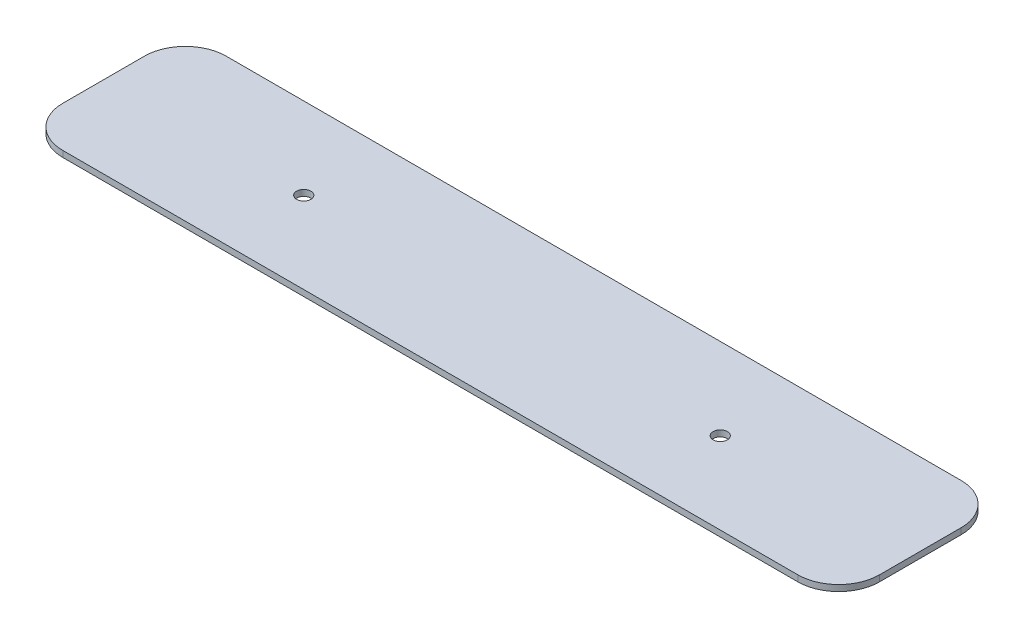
from build123d import *

# Parameters (mm, degrees)
SKETCH1_R      = 1.75
EXTRUDE1_DEPTH = 1.5


with BuildPart() as part:
    # Sketch1 → Extrude1 (new body)
    with BuildSketch(Plane(origin=(0, 0, 0), x_dir=(1, 0, 0), z_dir=(0, 1, 0))):
        with BuildLine():
            Line((10, 0), (190, 0))
            ThreePointArc((190, 0), (197.071067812, 2.928932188), (200, 10))
            Line((200, 10), (200, 30))
            ThreePointArc((200, 30), (197.071067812, 37.071067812), (190, 40))
            Line((190, 40), (10, 40))
            ThreePointArc((10, 40), (2.928932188, 37.071067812), (0, 30))
            Line((0, 30), (0, 10))
            ThreePointArc((0, 10), (2.928932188, 2.928932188), (10, 0))
        make_face()
        with Locations(Location((49, 20, 0), (0, 0, 270))):
            Circle(SKETCH1_R, mode=Mode.SUBTRACT)
        with Locations(Location((151, 20, 0), (0, 0, 270))):
            Circle(SKETCH1_R, mode=Mode.SUBTRACT)
    extrude(amount=EXTRUDE1_DEPTH)


solid = part.part
